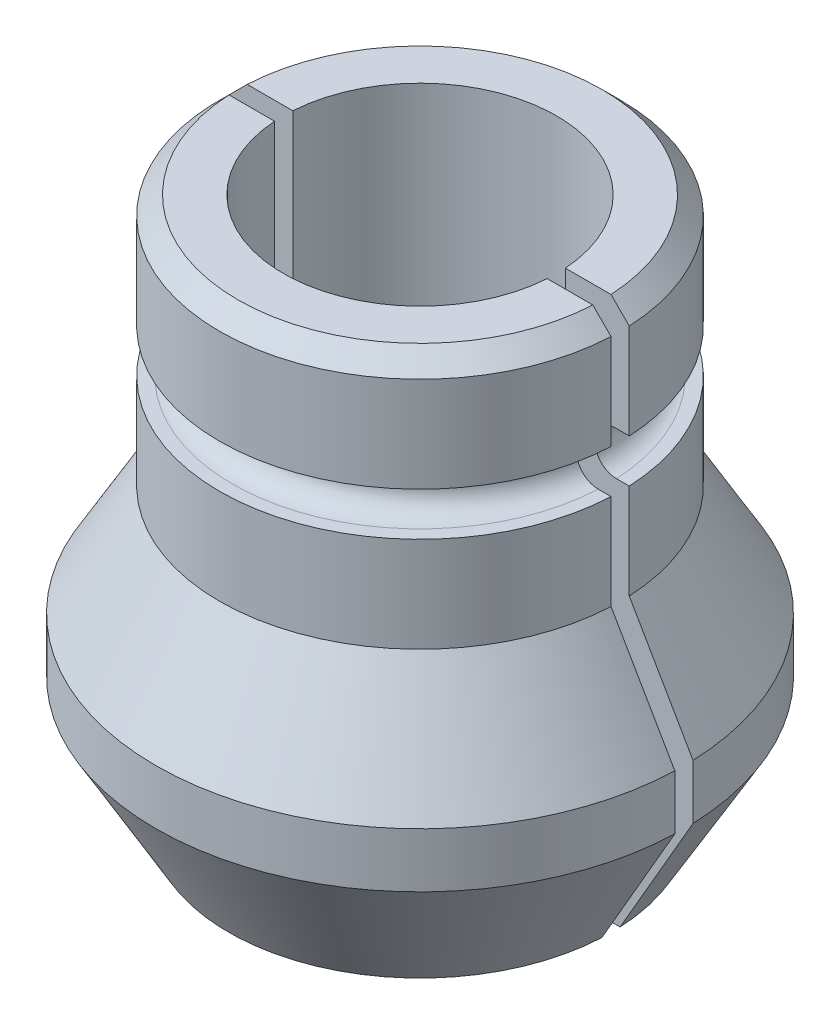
from build123d import *

# Parameters (mm, degrees)
SKETCH2_R          = 1.190625
SKETCH3_W          = 29
SKETCH3_H          = 29.82820323
CUT_EXTRUDE1_DEPTH = 0.5


with BuildPart() as part:
    # Sketch1 → Revolve1 (revolve)
    with BuildSketch(Plane.XY, mode=Mode.PRIVATE) as revolve1_sk:
        Polygon((7.5, 19.9), (10, 19.9), (11, 18.9), (11, 6.062177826), (14.5, 0), (14.5, -3), (10.5, -9.92820323), (7.5, -9.92820323), (7.5, -9.062177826), (11, -3), (11, 0), (7.5, 6.062177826), align=None)
    revolve(revolve1_sk.sketch.rotate(Axis((0, 0, 0), (0, 1, 0)), 90), axis=Axis((0, 0, 0), (0, 1, 0)))

    # Sketch2 → Cut-Revolve1 (revolve, cut)
    with BuildSketch(Plane(origin=(0, 0, 0), x_dir=(0, 0, -1), z_dir=(1, 0, 0)), mode=Mode.PRIVATE) as cut_revolve1_sk:
        with BuildLine():
            ThreePointArc((-11, 13.444202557), (-10.66802222, 13.613408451), (-10.3, 13.671713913))
            Line((-10.3, 13.671713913), (-11, 13.671713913))
            Line((-11, 13.671713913), (-11, 13.444202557))
        make_face()
        with Locations((-10.3, 12.481088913)):
            Circle(SKETCH2_R)
        with BuildLine():
            Line((-11, 11.290463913), (-10.3, 11.290463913))
            ThreePointArc((-10.3, 11.290463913), (-10.66802222, 11.348769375), (-11, 11.51797527))
            Line((-11, 11.51797527), (-11, 11.290463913))
        make_face()
    revolve(cut_revolve1_sk.sketch.rotate(Axis((0, 25.111962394, 0), (0, -1, 0)), 180), axis=Axis((0, 25.111962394, 0), (0, -1, 0)), mode=Mode.SUBTRACT)

    # Sketch3 → Cut-Extrude1 (cut, symmetric)
    with BuildSketch(Plane.XY):
        with Locations((0, 4.985898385)):
            Rectangle(SKETCH3_W, SKETCH3_H)
    extrude(amount=CUT_EXTRUDE1_DEPTH, both=True, mode=Mode.SUBTRACT)


with BuildPart() as cut_extrude1_piece_1:
    # of the separate pieces the step leaves, piece 1, a body of its own (cut_extrude1_pieces)
    add(part.part.solids().sort_by_distance((-7.483314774, 19.9, 0.5))[0])


with BuildPart() as cut_extrude1_piece_2:
    # of the separate pieces the step leaves, piece 2, a body of its own (cut_extrude1_pieces)
    add(part.part.solids().sort_by_distance((9.987492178, 19.9, -0.5))[0])


solid = Compound([cut_extrude1_piece_1.part, cut_extrude1_piece_2.part])
